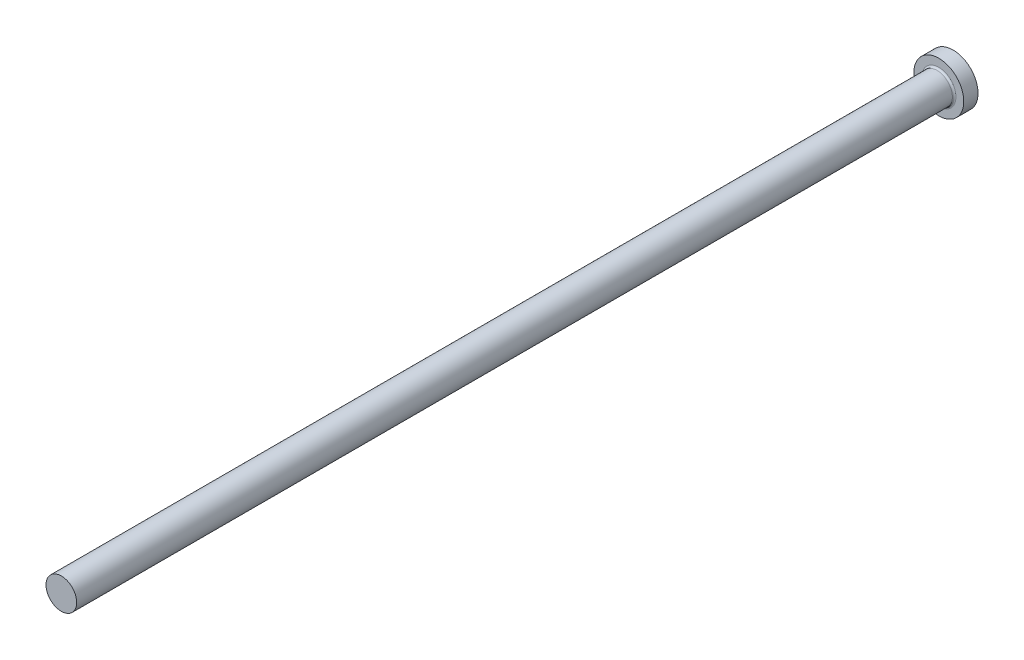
from build123d import *

# Parameters (mm, degrees)
FILLET1_R = 0.5


with BuildPart() as part:
    # FV → Revolve1 (revolve)
    with BuildSketch(Plane(origin=(0, 0, 0), x_dir=(1, 0, 0), z_dir=(0, 1, 0)), mode=Mode.PRIVATE) as revolve1_sk:
        Polygon((0, 0), (7, 0), (7, -4), (4.3, -4), (4.3, -250), (0, -250), align=None)
    revolve(revolve1_sk.sketch.rotate(Axis((0, 0, -9.033228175), (0, 0, 1)), 180), axis=Axis((0, 0, -9.033228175), (0, 0, 1)))

    # Fillet1
    fillet1_edges = [part.edges().sort_by_distance(p)[0] for p in [
        (4.3, 0, 4),
    ]]
    fillet(fillet1_edges, radius=FILLET1_R)


solid = part.part
